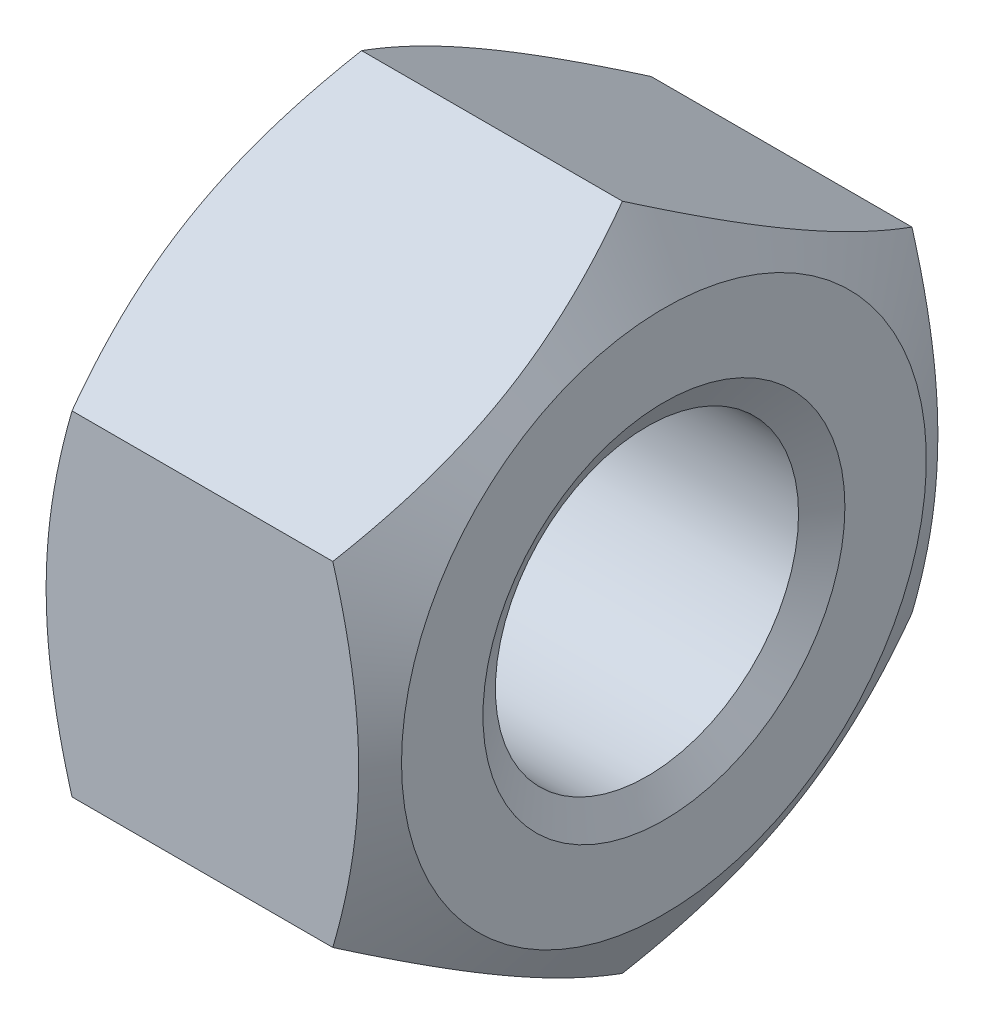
ISO-10303-21;
HEADER;
FILE_DESCRIPTION(('STEP AP214'),'2;1');
FILE_NAME('part.step','',(''),(''),'','','');
FILE_SCHEMA(('AUTOMOTIVE_DESIGN { 1 0 10303 214 1 1 1 1 }'));
ENDSEC;
DATA;
#1=APPLICATION_CONTEXT('core data for automotive mechanical design processes');
#2=APPLICATION_PROTOCOL_DEFINITION('international standard','automotive_design',2000,#1);
#3=PRODUCT_CONTEXT('',#1,'mechanical');
#4=PRODUCT('Part','Part','',(#3));
#5=PRODUCT_RELATED_PRODUCT_CATEGORY('part','',(#4));
#6=PRODUCT_DEFINITION_FORMATION('','',#4);
#7=PRODUCT_DEFINITION_CONTEXT('part definition',#1,'design');
#8=PRODUCT_DEFINITION('design','',#6,#7);
#9=PRODUCT_DEFINITION_SHAPE('','',#8);
#10=(LENGTH_UNIT() NAMED_UNIT(*) SI_UNIT(.MILLI.,.METRE.));
#11=(NAMED_UNIT(*) PLANE_ANGLE_UNIT() SI_UNIT($,.RADIAN.));
#12=(NAMED_UNIT(*) SI_UNIT($,.STERADIAN.) SOLID_ANGLE_UNIT());
#13=UNCERTAINTY_MEASURE_WITH_UNIT(LENGTH_MEASURE(1.E-05),#10,'distance_accuracy_value','');
#14=(GEOMETRIC_REPRESENTATION_CONTEXT(3) GLOBAL_UNCERTAINTY_ASSIGNED_CONTEXT((#13)) GLOBAL_UNIT_ASSIGNED_CONTEXT((#10,
#11,#12)) REPRESENTATION_CONTEXT('',''));
#15=CARTESIAN_POINT('',(0.,0.,0.));
#16=DIRECTION('',(0.,0.,1.));
#17=DIRECTION('',(1.,0.,0.));
#18=AXIS2_PLACEMENT_3D('',#15,#16,#17);
#19=CARTESIAN_POINT('',(0.,4.618802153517,8.));
#20=DIRECTION('',(0.,0.866025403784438,0.5));
#21=DIRECTION('',(0.,-0.5,0.866025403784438));
#22=AXIS2_PLACEMENT_3D('',#19,#20,#21);
#23=PLANE('',#22);
#24=CARTESIAN_POINT('',(8.35245610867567,4.61880213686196,8.00000002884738));
#25=CARTESIAN_POINT('',(8.41106048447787,4.72032750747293,7.82415292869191));
#26=CARTESIAN_POINT('',(8.46700497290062,4.82223139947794,7.64765021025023));
#27=CARTESIAN_POINT('',(8.57284159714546,5.02686676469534,7.29321136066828));
#28=CARTESIAN_POINT('',(8.62273112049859,5.1295985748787,7.11527464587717));
#29=CARTESIAN_POINT('',(8.7623378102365,5.4394387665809,6.57861569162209));
#30=CARTESIAN_POINT('',(8.84174318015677,5.64777019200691,6.21777507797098));
#31=CARTESIAN_POINT('',(8.93485338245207,5.95953412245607,5.67778411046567));
#32=CARTESIAN_POINT('',(8.96137739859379,6.06203531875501,5.50024683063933));
#33=CARTESIAN_POINT('',(9.0058527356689,6.26750119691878,5.14436949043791));
#34=CARTESIAN_POINT('',(9.02380481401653,6.37046583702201,4.96602950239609));
#35=CARTESIAN_POINT('',(9.05068130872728,6.57657235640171,4.60904253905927));
#36=CARTESIAN_POINT('',(9.05961596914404,6.67971390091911,4.430396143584));
#37=CARTESIAN_POINT('',(9.06826608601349,6.88609220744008,4.07293843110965));
#38=CARTESIAN_POINT('',(9.067981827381,6.9893289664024,3.89412711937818));
#39=CARTESIAN_POINT('',(9.05883609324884,7.18232642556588,3.55984571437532));
#40=CARTESIAN_POINT('',(9.05109027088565,7.27210075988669,3.404352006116));
#41=CARTESIAN_POINT('',(9.02877760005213,7.45143915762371,3.09372878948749));
#42=CARTESIAN_POINT('',(9.01421029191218,7.54100320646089,2.93859930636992));
#43=CARTESIAN_POINT('',(8.96062041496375,7.80934859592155,2.4738114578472));
#44=CARTESIAN_POINT('',(8.91171658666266,7.98765496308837,2.16497577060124));
#45=CARTESIAN_POINT('',(8.78945870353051,8.3461588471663,1.54402882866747));
#46=CARTESIAN_POINT('',(8.71558650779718,8.52631062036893,1.2319968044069));
#47=CARTESIAN_POINT('',(8.5479281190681,8.88392795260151,0.612585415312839));
#48=CARTESIAN_POINT('',(8.45418129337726,9.06139808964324,0.305198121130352));
#49=CARTESIAN_POINT('',(8.35245611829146,9.23760430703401,0.));
#50=B_SPLINE_CURVE_WITH_KNOTS('',3,(#24,#25,#26,#27,#28,#29,#30,#31,#32,#33,#34,#35,#36,#37,#38,
#39,#40,#41,#42,#43,#44,#45,#46,#47,#48,#49),.UNSPECIFIED.,.F.,.F.,(4,2,2,2,2,2,2,2,2,2,2,2,4),
(0.,0.633965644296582,1.26820385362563,2.53931507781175,3.15930424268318,3.77923861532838,
4.39846792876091,5.01767810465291,5.55669079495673,6.09573981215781,7.1746054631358,
8.27739518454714,9.37802059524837),.UNSPECIFIED.);
#51=CARTESIAN_POINT('',(8.35245611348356,4.61880214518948,8.00000001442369));
#52=VERTEX_POINT('',#51);
#53=CARTESIAN_POINT('',(8.35245611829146,9.23760430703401,0.));
#54=VERTEX_POINT('',#53);
#55=EDGE_CURVE('E175',#52,#54,#50,.T.);
#56=ORIENTED_EDGE('',*,*,#55,.T.);
#57=DIRECTION('',(1.,0.,0.));
#58=VECTOR('',#57,1.);
#59=CARTESIAN_POINT('',(0.,9.23760430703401,0.));
#60=LINE('',#59,#58);
#61=CARTESIAN_POINT('',(1.14754388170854,9.23760430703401,0.));
#62=VERTEX_POINT('',#61);
#63=EDGE_CURVE('E248',#62,#54,#60,.T.);
#64=ORIENTED_EDGE('',*,*,#63,.F.);
#65=CARTESIAN_POINT('',(1.14754388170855,9.23760430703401,0.));
#66=CARTESIAN_POINT('',(1.08893950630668,9.13607893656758,0.175847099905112));
#67=CARTESIAN_POINT('',(1.03299501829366,9.03417504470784,0.352349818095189));
#68=CARTESIAN_POINT('',(0.92715839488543,8.82953967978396,0.706788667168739));
#69=CARTESIAN_POINT('',(0.877268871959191,8.72680786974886,0.884725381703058));
#70=CARTESIAN_POINT('',(0.737662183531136,8.41696767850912,1.42138433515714));
#71=CARTESIAN_POINT('',(0.658256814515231,8.20863625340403,1.7822249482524));
#72=CARTESIAN_POINT('',(0.565146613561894,7.89687232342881,2.32221591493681));
#73=CARTESIAN_POINT('',(0.538622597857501,7.79437112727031,2.49975319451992));
#74=CARTESIAN_POINT('',(0.494147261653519,7.58890524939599,2.85563053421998));
#75=CARTESIAN_POINT('',(0.476195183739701,7.48594060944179,3.03397052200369));
#76=CARTESIAN_POINT('',(0.44931868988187,7.27983409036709,3.39095748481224));
#77=CARTESIAN_POINT('',(0.440384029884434,7.17669254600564,3.56960388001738));
#78=CARTESIAN_POINT('',(0.431733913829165,6.97031423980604,3.9270615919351));
#79=CARTESIAN_POINT('',(0.432018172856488,6.86707748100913,4.10587290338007));
#80=CARTESIAN_POINT('',(0.441163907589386,6.6740800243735,4.44015430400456));
#81=CARTESIAN_POINT('',(0.44890972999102,6.58430569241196,4.5956480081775));
#82=CARTESIAN_POINT('',(0.471222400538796,6.40496729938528,4.90627121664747));
#83=CARTESIAN_POINT('',(0.485789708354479,6.31540325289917,5.06140069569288));
#84=CARTESIAN_POINT('',(0.539379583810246,6.04705787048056,5.5261885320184));
#85=CARTESIAN_POINT('',(0.588283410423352,5.86875150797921,5.83502421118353));
#86=CARTESIAN_POINT('',(0.710541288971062,5.51024763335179,6.45597113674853));
#87=CARTESIAN_POINT('',(0.784413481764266,5.33009586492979,6.76800315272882));
#88=CARTESIAN_POINT('',(0.952071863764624,4.9724785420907,7.38741452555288));
#89=CARTESIAN_POINT('',(1.04581868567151,4.79500840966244,7.6948018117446));
#90=CARTESIAN_POINT('',(1.14754385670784,4.61880219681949,7.99999992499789));
#91=B_SPLINE_CURVE_WITH_KNOTS('',3,(#65,#66,#67,#68,#69,#70,#71,#72,#73,#74,#75,#76,#77,#78,#79,
#80,#81,#82,#83,#84,#85,#86,#87,#88,#89,#90),.UNSPECIFIED.,.F.,.F.,(4,2,2,2,2,2,2,2,2,2,2,2,4),
(0.,0.633965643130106,1.26820385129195,2.5393150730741,3.15930423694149,3.77923860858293,
4.39846792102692,5.01767809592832,5.55669077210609,6.09573977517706,7.17460539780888,
8.27739508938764,9.37802047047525),.UNSPECIFIED.);
#92=CARTESIAN_POINT('',(1.14754388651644,4.61880217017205,8.));
#93=VERTEX_POINT('',#92);
#94=EDGE_CURVE('E40',#62,#93,#91,.T.);
#95=ORIENTED_EDGE('',*,*,#94,.T.);
#96=DIRECTION('',(1.,0.,0.));
#97=VECTOR('',#96,1.);
#98=CARTESIAN_POINT('',(0.,4.61880215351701,8.));
#99=LINE('',#98,#97);
#100=EDGE_CURVE('E254',#52,#93,#99,.F.);
#101=ORIENTED_EDGE('',*,*,#100,.F.);
#102=EDGE_LOOP('',(#56,#64,#95,#101));
#103=FACE_BOUND('',#102,.T.);
#104=ADVANCED_FACE('F16',(#103),#23,.T.);
#105=CARTESIAN_POINT('',(0.,-4.61880215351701,8.));
#106=DIRECTION('',(0.,0.,1.));
#107=DIRECTION('',(1.,0.,0.));
#108=AXIS2_PLACEMENT_3D('',#105,#106,#107);
#109=PLANE('',#108);
#110=CARTESIAN_POINT('',(8.35245610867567,-4.6188021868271,8.));
#111=CARTESIAN_POINT('',(8.41106048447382,-4.41575144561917,8.));
#112=CARTESIAN_POINT('',(8.46700497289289,-4.21194366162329,8.));
#113=CARTESIAN_POINT('',(8.57284159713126,-3.80267293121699,8.));
#114=CARTESIAN_POINT('',(8.62273112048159,-3.59720931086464,8.));
#115=CARTESIAN_POINT('',(8.76233781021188,-2.97752892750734,8.));
#116=CARTESIAN_POINT('',(8.84174318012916,-2.56086607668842,8.));
#117=CARTESIAN_POINT('',(8.93485338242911,-1.93733821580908,8.));
#118=CARTESIAN_POINT('',(8.96137739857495,-1.73233582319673,8.));
#119=CARTESIAN_POINT('',(9.00585273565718,-1.32140406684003,8.));
#120=CARTESIAN_POINT('',(9.02380481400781,-1.11547478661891,8.));
#121=CARTESIAN_POINT('',(9.05068130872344,-0.703261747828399,8.));
#122=CARTESIAN_POINT('',(9.05961596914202,-0.496978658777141,8.));
#123=CARTESIAN_POINT('',(9.06826608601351,-0.0842220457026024,8.));
#124=CARTESIAN_POINT('',(9.06798182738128,0.122251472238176,8.));
#125=CARTESIAN_POINT('',(9.05883609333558,0.508246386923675,8.));
#126=CARTESIAN_POINT('',(9.05109027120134,0.687795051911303,8.));
#127=CARTESIAN_POINT('',(9.02877760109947,1.04647184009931,8.));
#128=CARTESIAN_POINT('',(9.0142102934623,1.22559993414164,8.));
#129=CARTESIAN_POINT('',(8.96062041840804,1.7622907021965,8.));
#130=CARTESIAN_POINT('',(8.91171659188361,2.11890342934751,8.));
#131=CARTESIAN_POINT('',(8.78945871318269,2.83591118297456,8.));
#132=CARTESIAN_POINT('',(8.71558652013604,3.19621472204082,8.));
#133=CARTESIAN_POINT('',(8.5479281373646,3.91144937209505,8.));
#134=CARTESIAN_POINT('',(8.45418131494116,4.26638963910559,8.));
#135=CARTESIAN_POINT('',(8.35245614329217,4.61880206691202,8.));
#136=B_SPLINE_CURVE_WITH_KNOTS('',3,(#110,#111,#112,#113,#114,#115,#116,#117,#118,#119,#120,
#121,#122,#123,#124,#125,#126,#127,#128,#129,#130,#131,#132,#133,#134,#135),.UNSPECIFIED.,.F.,
.F.,(4,2,2,2,2,2,2,2,2,2,2,2,4),(0.,0.633965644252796,1.26820385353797,2.53931507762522,
3.15930424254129,3.77923861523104,4.39846792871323,5.01767810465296,5.55669078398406,
6.09573979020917,7.17460541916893,8.27739511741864,9.37802050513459),.UNSPECIFIED.);
#137=CARTESIAN_POINT('',(8.35245611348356,-4.61880217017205,8.));
#138=VERTEX_POINT('',#137);
#139=EDGE_CURVE('E77',#138,#52,#136,.T.);
#140=ORIENTED_EDGE('',*,*,#139,.T.);
#141=ORIENTED_EDGE('',*,*,#100,.T.);
#142=CARTESIAN_POINT('',(1.14754389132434,4.61880218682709,8.));
#143=CARTESIAN_POINT('',(1.08893951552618,4.41575144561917,8.));
#144=CARTESIAN_POINT('',(1.03299502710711,4.21194366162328,8.));
#145=CARTESIAN_POINT('',(0.927158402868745,3.80267293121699,8.));
#146=CARTESIAN_POINT('',(0.877268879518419,3.59720931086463,8.));
#147=CARTESIAN_POINT('',(0.737662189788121,2.97752892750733,8.));
#148=CARTESIAN_POINT('',(0.658256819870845,2.56086607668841,8.));
#149=CARTESIAN_POINT('',(0.565146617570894,1.93733821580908,8.));
#150=CARTESIAN_POINT('',(0.538622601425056,1.73233582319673,8.));
#151=CARTESIAN_POINT('',(0.494147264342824,1.32140406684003,8.));
#152=CARTESIAN_POINT('',(0.476195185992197,1.11547478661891,8.));
#153=CARTESIAN_POINT('',(0.449318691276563,0.703261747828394,8.));
#154=CARTESIAN_POINT('',(0.440384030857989,0.496978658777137,8.));
#155=CARTESIAN_POINT('',(0.431733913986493,0.0842220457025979,8.));
#156=CARTESIAN_POINT('',(0.432018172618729,-0.12225147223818,8.));
#157=CARTESIAN_POINT('',(0.441163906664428,-0.508246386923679,8.));
#158=CARTESIAN_POINT('',(0.448909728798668,-0.687795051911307,8.));
#159=CARTESIAN_POINT('',(0.47122239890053,-1.04647184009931,8.));
#160=CARTESIAN_POINT('',(0.485789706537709,-1.22559993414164,8.));
#161=CARTESIAN_POINT('',(0.539379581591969,-1.7622907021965,8.));
#162=CARTESIAN_POINT('',(0.588283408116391,-2.11890342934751,8.));
#163=CARTESIAN_POINT('',(0.71054128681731,-2.83591118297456,8.));
#164=CARTESIAN_POINT('',(0.784413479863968,-3.19621472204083,8.));
#165=CARTESIAN_POINT('',(0.9520718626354,-3.91144937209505,8.));
#166=CARTESIAN_POINT('',(1.04581868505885,-4.2663896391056,8.));
#167=CARTESIAN_POINT('',(1.14754385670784,-4.61880206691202,8.));
#168=B_SPLINE_CURVE_WITH_KNOTS('',3,(#142,#143,#144,#145,#146,#147,#148,#149,#150,#151,#152,
#153,#154,#155,#156,#157,#158,#159,#160,#161,#162,#163,#164,#165,#166,#167),.UNSPECIFIED.,.F.,
.F.,(4,2,2,2,2,2,2,2,2,2,2,2,4),(0.,0.633965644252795,1.26820385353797,2.53931507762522,
3.15930424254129,3.77923861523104,4.39846792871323,5.01767810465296,5.55669078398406,
6.09573979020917,7.17460541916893,8.27739511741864,9.37802050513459),.UNSPECIFIED.);
#169=CARTESIAN_POINT('',(1.14754388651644,-4.61880214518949,8.00000001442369));
#170=VERTEX_POINT('',#169);
#171=EDGE_CURVE('E98',#93,#170,#168,.T.);
#172=ORIENTED_EDGE('',*,*,#171,.T.);
#173=DIRECTION('',(1.,0.,0.));
#174=VECTOR('',#173,1.);
#175=CARTESIAN_POINT('',(0.,-4.61880215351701,8.));
#176=LINE('',#175,#174);
#177=EDGE_CURVE('E92',#138,#170,#176,.F.);
#178=ORIENTED_EDGE('',*,*,#177,.F.);
#179=EDGE_LOOP('',(#140,#141,#172,#178));
#180=FACE_BOUND('',#179,.T.);
#181=ADVANCED_FACE('F185',(#180),#109,.T.);
#182=CARTESIAN_POINT('',(0.,-9.23760430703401,0.));
#183=DIRECTION('',(0.,-0.866025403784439,0.5));
#184=DIRECTION('',(0.,-0.5,-0.866025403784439));
#185=AXIS2_PLACEMENT_3D('',#182,#183,#184);
#186=PLANE('',#185);
#187=CARTESIAN_POINT('',(8.35245611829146,-9.23760430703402,0.));
#188=CARTESIAN_POINT('',(8.41106049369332,-9.13607893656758,0.175847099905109));
#189=CARTESIAN_POINT('',(8.46700498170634,-9.03417504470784,0.352349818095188));
#190=CARTESIAN_POINT('',(8.57284160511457,-8.82953967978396,0.706788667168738));
#191=CARTESIAN_POINT('',(8.62273112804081,-8.72680786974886,0.884725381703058));
#192=CARTESIAN_POINT('',(8.76233781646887,-8.41696767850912,1.42138433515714));
#193=CARTESIAN_POINT('',(8.84174318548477,-8.20863625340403,1.78222494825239));
#194=CARTESIAN_POINT('',(8.93485338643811,-7.89687232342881,2.32221591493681));
#195=CARTESIAN_POINT('',(8.9613774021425,-7.79437112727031,2.49975319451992));
#196=CARTESIAN_POINT('',(9.00585273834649,-7.58890524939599,2.85563053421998));
#197=CARTESIAN_POINT('',(9.0238048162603,-7.48594060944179,3.03397052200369));
#198=CARTESIAN_POINT('',(9.05068131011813,-7.27983409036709,3.39095748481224));
#199=CARTESIAN_POINT('',(9.05961597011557,-7.17669254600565,3.56960388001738));
#200=CARTESIAN_POINT('',(9.06826608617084,-6.97031423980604,3.9270615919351));
#201=CARTESIAN_POINT('',(9.06798182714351,-6.86707748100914,4.10587290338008));
#202=CARTESIAN_POINT('',(9.05883609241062,-6.67408002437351,4.44015430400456));
#203=CARTESIAN_POINT('',(9.05109027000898,-6.58430569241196,4.5956480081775));
#204=CARTESIAN_POINT('',(9.02877759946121,-6.40496729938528,4.90627121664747));
#205=CARTESIAN_POINT('',(9.01421029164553,-6.31540325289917,5.06140069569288));
#206=CARTESIAN_POINT('',(8.96062041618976,-6.04705787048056,5.5261885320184));
#207=CARTESIAN_POINT('',(8.91171658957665,-5.86875150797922,5.83502421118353));
#208=CARTESIAN_POINT('',(8.78945871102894,-5.51024763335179,6.45597113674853));
#209=CARTESIAN_POINT('',(8.71558651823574,-5.33009586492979,6.76800315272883));
#210=CARTESIAN_POINT('',(8.54792813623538,-4.97247854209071,7.38741452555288));
#211=CARTESIAN_POINT('',(8.45418131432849,-4.79500840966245,7.6948018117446));
#212=CARTESIAN_POINT('',(8.35245614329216,-4.61880219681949,7.9999999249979));
#213=B_SPLINE_CURVE_WITH_KNOTS('',3,(#187,#188,#189,#190,#191,#192,#193,#194,#195,#196,#197,
#198,#199,#200,#201,#202,#203,#204,#205,#206,#207,#208,#209,#210,#211,#212),.UNSPECIFIED.,.F.,
.F.,(4,2,2,2,2,2,2,2,2,2,2,2,4),(0.,0.633965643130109,1.26820385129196,2.5393150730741,
3.15930423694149,3.77923860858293,4.39846792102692,5.01767809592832,5.55669077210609,
6.09573977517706,7.17460539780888,8.27739508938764,9.37802047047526),.UNSPECIFIED.);
#214=CARTESIAN_POINT('',(8.35245611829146,-9.23760430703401,0.));
#215=VERTEX_POINT('',#214);
#216=EDGE_CURVE('E20',#215,#138,#213,.T.);
#217=ORIENTED_EDGE('',*,*,#216,.T.);
#218=ORIENTED_EDGE('',*,*,#177,.T.);
#219=CARTESIAN_POINT('',(1.14754389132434,-4.61880213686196,8.00000002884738));
#220=CARTESIAN_POINT('',(1.08893951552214,-4.72032750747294,7.82415292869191));
#221=CARTESIAN_POINT('',(1.03299502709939,-4.82223139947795,7.64765021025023));
#222=CARTESIAN_POINT('',(0.927158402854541,-5.02686676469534,7.29321136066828));
#223=CARTESIAN_POINT('',(0.877268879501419,-5.12959857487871,7.11527464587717));
#224=CARTESIAN_POINT('',(0.737662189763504,-5.4394387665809,6.57861569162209));
#225=CARTESIAN_POINT('',(0.658256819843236,-5.64777019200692,6.21777507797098));
#226=CARTESIAN_POINT('',(0.565146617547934,-5.95953412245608,5.67778411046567));
#227=CARTESIAN_POINT('',(0.538622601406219,-6.06203531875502,5.50024683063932));
#228=CARTESIAN_POINT('',(0.494147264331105,-6.26750119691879,5.14436949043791));
#229=CARTESIAN_POINT('',(0.476195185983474,-6.37046583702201,4.96602950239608));
#230=CARTESIAN_POINT('',(0.449318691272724,-6.57657235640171,4.60904253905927));
#231=CARTESIAN_POINT('',(0.440384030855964,-6.67971390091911,4.43039614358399));
#232=CARTESIAN_POINT('',(0.43173391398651,-6.88609220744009,4.07293843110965));
#233=CARTESIAN_POINT('',(0.432018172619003,-6.9893289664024,3.89412711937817));
#234=CARTESIAN_POINT('',(0.441163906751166,-7.18232642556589,3.55984571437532));
#235=CARTESIAN_POINT('',(0.448909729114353,-7.2721007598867,3.404352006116));
#236=CARTESIAN_POINT('',(0.471222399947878,-7.45143915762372,3.09372878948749));
#237=CARTESIAN_POINT('',(0.485789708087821,-7.5410032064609,2.93859930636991));
#238=CARTESIAN_POINT('',(0.539379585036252,-7.80934859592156,2.47381145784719));
#239=CARTESIAN_POINT('',(0.588283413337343,-7.98765496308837,2.16497577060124));
#240=CARTESIAN_POINT('',(0.710541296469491,-8.34615884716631,1.54402882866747));
#241=CARTESIAN_POINT('',(0.784413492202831,-8.52631062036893,1.2319968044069));
#242=CARTESIAN_POINT('',(0.952071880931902,-8.88392795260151,0.612585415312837));
#243=CARTESIAN_POINT('',(1.04581870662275,-9.06139808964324,0.305198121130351));
#244=CARTESIAN_POINT('',(1.14754388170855,-9.23760430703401,0.));
#245=B_SPLINE_CURVE_WITH_KNOTS('',3,(#219,#220,#221,#222,#223,#224,#225,#226,#227,#228,#229,
#230,#231,#232,#233,#234,#235,#236,#237,#238,#239,#240,#241,#242,#243,#244),.UNSPECIFIED.,.F.,
.F.,(4,2,2,2,2,2,2,2,2,2,2,2,4),(0.,0.633965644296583,1.26820385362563,2.53931507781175,
3.15930424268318,3.77923861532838,4.39846792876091,5.01767810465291,5.55669079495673,
6.09573981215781,7.1746054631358,8.27739518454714,9.37802059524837),.UNSPECIFIED.);
#246=CARTESIAN_POINT('',(1.14754388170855,-9.23760430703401,0.));
#247=VERTEX_POINT('',#246);
#248=EDGE_CURVE('E87',#170,#247,#245,.T.);
#249=ORIENTED_EDGE('',*,*,#248,.T.);
#250=DIRECTION('',(1.,0.,0.));
#251=VECTOR('',#250,1.);
#252=CARTESIAN_POINT('',(0.,-9.23760430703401,0.));
#253=LINE('',#252,#251);
#254=EDGE_CURVE('E83',#215,#247,#253,.F.);
#255=ORIENTED_EDGE('',*,*,#254,.F.);
#256=EDGE_LOOP('',(#217,#218,#249,#255));
#257=FACE_BOUND('',#256,.T.);
#258=ADVANCED_FACE('F84',(#257),#186,.T.);
#259=CARTESIAN_POINT('',(0.,-4.61880215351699,-8.00000000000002));
#260=DIRECTION('',(0.,-0.866025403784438,-0.500000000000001));
#261=DIRECTION('',(0.,0.500000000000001,-0.866025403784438));
#262=AXIS2_PLACEMENT_3D('',#259,#260,#261);
#263=PLANE('',#262);
#264=CARTESIAN_POINT('',(8.35245610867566,-4.61880213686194,-8.0000000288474));
#265=CARTESIAN_POINT('',(8.41106048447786,-4.72032750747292,-7.82415292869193));
#266=CARTESIAN_POINT('',(8.46700497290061,-4.82223139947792,-7.64765021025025));
#267=CARTESIAN_POINT('',(8.57284159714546,-5.02686676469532,-7.2932113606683));
#268=CARTESIAN_POINT('',(8.62273112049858,-5.12959857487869,-7.11527464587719));
#269=CARTESIAN_POINT('',(8.7623378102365,-5.43943876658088,-6.57861569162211));
#270=CARTESIAN_POINT('',(8.84174318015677,-5.6477701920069,-6.217775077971));
#271=CARTESIAN_POINT('',(8.93485338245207,-5.95953412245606,-5.67778411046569));
#272=CARTESIAN_POINT('',(8.96137739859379,-6.06203531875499,-5.50024683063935));
#273=CARTESIAN_POINT('',(9.0058527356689,-6.26750119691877,-5.14436949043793));
#274=CARTESIAN_POINT('',(9.02380481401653,-6.37046583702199,-4.9660295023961));
#275=CARTESIAN_POINT('',(9.05068130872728,-6.57657235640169,-4.60904253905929));
#276=CARTESIAN_POINT('',(9.05961596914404,-6.6797139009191,-4.43039614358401));
#277=CARTESIAN_POINT('',(9.0682660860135,-6.88609220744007,-4.07293843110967));
#278=CARTESIAN_POINT('',(9.067981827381,-6.98932896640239,-3.89412711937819));
#279=CARTESIAN_POINT('',(9.05883609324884,-7.18232642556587,-3.55984571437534));
#280=CARTESIAN_POINT('',(9.05109027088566,-7.27210075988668,-3.40435200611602));
#281=CARTESIAN_POINT('',(9.02877760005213,-7.4514391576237,-3.0937287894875));
#282=CARTESIAN_POINT('',(9.01421029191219,-7.54100320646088,-2.93859930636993));
#283=CARTESIAN_POINT('',(8.96062041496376,-7.80934859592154,-2.47381145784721));
#284=CARTESIAN_POINT('',(8.91171658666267,-7.98765496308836,-2.16497577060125));
#285=CARTESIAN_POINT('',(8.78945870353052,-8.3461588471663,-1.54402882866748));
#286=CARTESIAN_POINT('',(8.71558650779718,-8.52631062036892,-1.23199680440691));
#287=CARTESIAN_POINT('',(8.54792811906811,-8.8839279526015,-0.61258541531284));
#288=CARTESIAN_POINT('',(8.45418129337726,-9.06139808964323,-0.305198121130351));
#289=CARTESIAN_POINT('',(8.35245611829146,-9.23760430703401,0.));
#290=B_SPLINE_CURVE_WITH_KNOTS('',3,(#264,#265,#266,#267,#268,#269,#270,#271,#272,#273,#274,
#275,#276,#277,#278,#279,#280,#281,#282,#283,#284,#285,#286,#287,#288,#289),.UNSPECIFIED.,.F.,
.F.,(4,2,2,2,2,2,2,2,2,2,2,2,4),(0.,0.633965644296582,1.26820385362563,2.53931507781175,
3.15930424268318,3.77923861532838,4.39846792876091,5.01767810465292,5.55669079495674,
6.09573981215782,7.17460546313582,8.27739518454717,9.3780205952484),.UNSPECIFIED.);
#291=CARTESIAN_POINT('',(8.35245611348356,-4.61880214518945,-8.00000001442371));
#292=VERTEX_POINT('',#291);
#293=EDGE_CURVE('E73',#292,#215,#290,.T.);
#294=ORIENTED_EDGE('',*,*,#293,.T.);
#295=ORIENTED_EDGE('',*,*,#254,.T.);
#296=CARTESIAN_POINT('',(1.14754388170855,-9.23760430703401,0.));
#297=CARTESIAN_POINT('',(1.08893950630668,-9.13607893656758,-0.175847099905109));
#298=CARTESIAN_POINT('',(1.03299501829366,-9.03417504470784,-0.352349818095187));
#299=CARTESIAN_POINT('',(0.927158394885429,-8.82953967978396,-0.706788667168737));
#300=CARTESIAN_POINT('',(0.877268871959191,-8.72680786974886,-0.884725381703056));
#301=CARTESIAN_POINT('',(0.737662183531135,-8.41696767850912,-1.42138433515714));
#302=CARTESIAN_POINT('',(0.658256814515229,-8.20863625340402,-1.78222494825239));
#303=CARTESIAN_POINT('',(0.565146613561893,-7.89687232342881,-2.32221591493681));
#304=CARTESIAN_POINT('',(0.5386225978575,-7.79437112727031,-2.49975319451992));
#305=CARTESIAN_POINT('',(0.494147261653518,-7.58890524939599,-2.85563053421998));
#306=CARTESIAN_POINT('',(0.476195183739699,-7.48594060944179,-3.03397052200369));
#307=CARTESIAN_POINT('',(0.449318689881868,-7.27983409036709,-3.39095748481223));
#308=CARTESIAN_POINT('',(0.440384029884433,-7.17669254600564,-3.56960388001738));
#309=CARTESIAN_POINT('',(0.431733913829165,-6.97031423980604,-3.9270615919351));
#310=CARTESIAN_POINT('',(0.432018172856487,-6.86707748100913,-4.10587290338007));
#311=CARTESIAN_POINT('',(0.441163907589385,-6.6740800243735,-4.44015430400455));
#312=CARTESIAN_POINT('',(0.448909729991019,-6.58430569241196,-4.5956480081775));
#313=CARTESIAN_POINT('',(0.471222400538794,-6.40496729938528,-4.90627121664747));
#314=CARTESIAN_POINT('',(0.485789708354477,-6.31540325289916,-5.06140069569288));
#315=CARTESIAN_POINT('',(0.539379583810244,-6.04705787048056,-5.52618853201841));
#316=CARTESIAN_POINT('',(0.588283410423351,-5.86875150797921,-5.83502421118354));
#317=CARTESIAN_POINT('',(0.710541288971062,-5.51024763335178,-6.45597113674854));
#318=CARTESIAN_POINT('',(0.784413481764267,-5.33009586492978,-6.76800315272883));
#319=CARTESIAN_POINT('',(0.952071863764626,-4.97247854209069,-7.38741452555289));
#320=CARTESIAN_POINT('',(1.04581868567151,-4.79500840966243,-7.69480181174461));
#321=CARTESIAN_POINT('',(1.14754385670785,-4.61880219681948,-7.99999992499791));
#322=B_SPLINE_CURVE_WITH_KNOTS('',3,(#296,#297,#298,#299,#300,#301,#302,#303,#304,#305,#306,
#307,#308,#309,#310,#311,#312,#313,#314,#315,#316,#317,#318,#319,#320,#321),.UNSPECIFIED.,.F.,
.F.,(4,2,2,2,2,2,2,2,2,2,2,2,4),(0.,0.633965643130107,1.26820385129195,2.5393150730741,
3.15930423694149,3.77923860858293,4.39846792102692,5.01767809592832,5.55669077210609,
6.09573977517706,7.17460539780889,8.27739508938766,9.37802047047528),.UNSPECIFIED.);
#323=CARTESIAN_POINT('',(1.14754388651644,-4.61880217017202,-8.00000000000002));
#324=VERTEX_POINT('',#323);
#325=EDGE_CURVE('E128',#247,#324,#322,.T.);
#326=ORIENTED_EDGE('',*,*,#325,.T.);
#327=DIRECTION('',(1.,0.,0.));
#328=VECTOR('',#327,1.);
#329=CARTESIAN_POINT('',(0.,-4.61880215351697,-8.00000000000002));
#330=LINE('',#329,#328);
#331=EDGE_CURVE('E91',#292,#324,#330,.F.);
#332=ORIENTED_EDGE('',*,*,#331,.F.);
#333=EDGE_LOOP('',(#294,#295,#326,#332));
#334=FACE_BOUND('',#333,.T.);
#335=ADVANCED_FACE('F94',(#334),#263,.T.);
#336=CARTESIAN_POINT('',(0.,4.61880215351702,-8.));
#337=DIRECTION('',(0.,0.,-1.));
#338=DIRECTION('',(0.,1.,0.));
#339=AXIS2_PLACEMENT_3D('',#336,#337,#338);
#340=PLANE('',#339);
#341=CARTESIAN_POINT('',(8.35245610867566,4.6188021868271,-8.));
#342=CARTESIAN_POINT('',(8.41106048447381,4.41575144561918,-8.));
#343=CARTESIAN_POINT('',(8.46700497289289,4.21194366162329,-8.));
#344=CARTESIAN_POINT('',(8.57284159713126,3.802672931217,-8.));
#345=CARTESIAN_POINT('',(8.62273112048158,3.59720931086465,-8.));
#346=CARTESIAN_POINT('',(8.76233781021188,2.97752892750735,-8.));
#347=CARTESIAN_POINT('',(8.84174318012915,2.56086607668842,-8.));
#348=CARTESIAN_POINT('',(8.9348533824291,1.93733821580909,-8.00000000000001));
#349=CARTESIAN_POINT('',(8.96137739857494,1.73233582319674,-8.00000000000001));
#350=CARTESIAN_POINT('',(9.00585273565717,1.32140406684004,-8.00000000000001));
#351=CARTESIAN_POINT('',(9.0238048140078,1.11547478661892,-8.00000000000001));
#352=CARTESIAN_POINT('',(9.05068130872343,0.703261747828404,-8.00000000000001));
#353=CARTESIAN_POINT('',(9.05961596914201,0.496978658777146,-8.00000000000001));
#354=CARTESIAN_POINT('',(9.0682660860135,0.0842220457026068,-8.00000000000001));
#355=CARTESIAN_POINT('',(9.06798182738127,-0.122251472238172,-8.00000000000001));
#356=CARTESIAN_POINT('',(9.05883609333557,-0.50824638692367,-8.00000000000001));
#357=CARTESIAN_POINT('',(9.05109027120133,-0.687795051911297,-8.00000000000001));
#358=CARTESIAN_POINT('',(9.02877760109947,-1.0464718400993,-8.00000000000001));
#359=CARTESIAN_POINT('',(9.01421029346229,-1.22559993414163,-8.00000000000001));
#360=CARTESIAN_POINT('',(8.96062041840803,-1.76229070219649,-8.00000000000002));
#361=CARTESIAN_POINT('',(8.91171659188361,-2.11890342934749,-8.00000000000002));
#362=CARTESIAN_POINT('',(8.78945871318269,-2.83591118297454,-8.00000000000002));
#363=CARTESIAN_POINT('',(8.71558652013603,-3.1962147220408,-8.00000000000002));
#364=CARTESIAN_POINT('',(8.5479281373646,-3.91144937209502,-8.00000000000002));
#365=CARTESIAN_POINT('',(8.45418131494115,-4.26638963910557,-8.00000000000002));
#366=CARTESIAN_POINT('',(8.35245614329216,-4.61880206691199,-8.00000000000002));
#367=B_SPLINE_CURVE_WITH_KNOTS('',3,(#341,#342,#343,#344,#345,#346,#347,#348,#349,#350,#351,
#352,#353,#354,#355,#356,#357,#358,#359,#360,#361,#362,#363,#364,#365,#366),.UNSPECIFIED.,.F.,
.F.,(4,2,2,2,2,2,2,2,2,2,2,2,4),(0.,0.633965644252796,1.26820385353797,2.53931507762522,
3.15930424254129,3.77923861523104,4.39846792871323,5.01767810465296,5.55669078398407,
6.09573979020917,7.17460541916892,8.27739511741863,9.37802050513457),.UNSPECIFIED.);
#368=CARTESIAN_POINT('',(8.35245611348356,4.61880217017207,-8.));
#369=VERTEX_POINT('',#368);
#370=EDGE_CURVE('E96',#369,#292,#367,.T.);
#371=ORIENTED_EDGE('',*,*,#370,.T.);
#372=ORIENTED_EDGE('',*,*,#331,.T.);
#373=CARTESIAN_POINT('',(1.14754389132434,-4.61880218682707,-8.00000000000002));
#374=CARTESIAN_POINT('',(1.08893951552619,-4.41575144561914,-8.00000000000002));
#375=CARTESIAN_POINT('',(1.03299502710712,-4.21194366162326,-8.00000000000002));
#376=CARTESIAN_POINT('',(0.927158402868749,-3.80267293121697,-8.00000000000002));
#377=CARTESIAN_POINT('',(0.877268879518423,-3.59720931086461,-8.00000000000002));
#378=CARTESIAN_POINT('',(0.737662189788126,-2.97752892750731,-8.00000000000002));
#379=CARTESIAN_POINT('',(0.65825681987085,-2.56086607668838,-8.00000000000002));
#380=CARTESIAN_POINT('',(0.565146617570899,-1.93733821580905,-8.00000000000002));
#381=CARTESIAN_POINT('',(0.538622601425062,-1.7323358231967,-8.00000000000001));
#382=CARTESIAN_POINT('',(0.494147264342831,-1.32140406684,-8.00000000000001));
#383=CARTESIAN_POINT('',(0.476195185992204,-1.11547478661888,-8.00000000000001));
#384=CARTESIAN_POINT('',(0.449318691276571,-0.703261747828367,-8.00000000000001));
#385=CARTESIAN_POINT('',(0.440384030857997,-0.49697865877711,-8.00000000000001));
#386=CARTESIAN_POINT('',(0.431733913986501,-0.0842220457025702,-8.00000000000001));
#387=CARTESIAN_POINT('',(0.432018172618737,0.122251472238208,-8.00000000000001));
#388=CARTESIAN_POINT('',(0.441163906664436,0.508246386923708,-8.00000000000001));
#389=CARTESIAN_POINT('',(0.448909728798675,0.687795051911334,-8.00000000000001));
#390=CARTESIAN_POINT('',(0.471222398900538,1.04647184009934,-8.00000000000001));
#391=CARTESIAN_POINT('',(0.485789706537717,1.22559993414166,-8.00000000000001));
#392=CARTESIAN_POINT('',(0.539379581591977,1.76229070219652,-8.00000000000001));
#393=CARTESIAN_POINT('',(0.588283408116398,2.11890342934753,-8.00000000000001));
#394=CARTESIAN_POINT('',(0.710541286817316,2.83591118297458,-8.00000000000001));
#395=CARTESIAN_POINT('',(0.784413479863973,3.19621472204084,-8.));
#396=CARTESIAN_POINT('',(0.952071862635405,3.91144937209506,-8.));
#397=CARTESIAN_POINT('',(1.04581868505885,4.26638963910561,-8.));
#398=CARTESIAN_POINT('',(1.14754385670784,4.61880206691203,-8.));
#399=B_SPLINE_CURVE_WITH_KNOTS('',3,(#373,#374,#375,#376,#377,#378,#379,#380,#381,#382,#383,
#384,#385,#386,#387,#388,#389,#390,#391,#392,#393,#394,#395,#396,#397,#398),.UNSPECIFIED.,.F.,
.F.,(4,2,2,2,2,2,2,2,2,2,2,2,4),(0.,0.633965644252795,1.26820385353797,2.53931507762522,
3.15930424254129,3.77923861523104,4.39846792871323,5.01767810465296,5.55669078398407,
6.09573979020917,7.17460541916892,8.27739511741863,9.37802050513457),.UNSPECIFIED.);
#400=CARTESIAN_POINT('',(1.14754388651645,4.6188021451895,-8.00000001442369));
#401=VERTEX_POINT('',#400);
#402=EDGE_CURVE('E134',#324,#401,#399,.T.);
#403=ORIENTED_EDGE('',*,*,#402,.T.);
#404=DIRECTION('',(1.,0.,0.));
#405=VECTOR('',#404,1.);
#406=CARTESIAN_POINT('',(0.,4.61880215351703,-7.99999999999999));
#407=LINE('',#406,#405);
#408=EDGE_CURVE('E80',#369,#401,#407,.F.);
#409=ORIENTED_EDGE('',*,*,#408,.F.);
#410=EDGE_LOOP('',(#371,#372,#403,#409));
#411=FACE_BOUND('',#410,.T.);
#412=ADVANCED_FACE('F121',(#411),#340,.T.);
#413=CARTESIAN_POINT('',(0.,9.23760430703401,0.));
#414=DIRECTION('',(0.,0.86602540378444,-0.499999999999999));
#415=DIRECTION('',(0.,0.499999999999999,0.86602540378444));
#416=AXIS2_PLACEMENT_3D('',#413,#414,#415);
#417=PLANE('',#416);
#418=CARTESIAN_POINT('',(8.35245611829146,9.23760430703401,0.));
#419=CARTESIAN_POINT('',(8.41106049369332,9.13607893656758,-0.175847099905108));
#420=CARTESIAN_POINT('',(8.46700498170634,9.03417504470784,-0.352349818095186));
#421=CARTESIAN_POINT('',(8.57284160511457,8.82953967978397,-0.706788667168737));
#422=CARTESIAN_POINT('',(8.62273112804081,8.72680786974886,-0.884725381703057));
#423=CARTESIAN_POINT('',(8.76233781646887,8.41696767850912,-1.42138433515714));
#424=CARTESIAN_POINT('',(8.84174318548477,8.20863625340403,-1.7822249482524));
#425=CARTESIAN_POINT('',(8.93485338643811,7.89687232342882,-2.32221591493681));
#426=CARTESIAN_POINT('',(8.9613774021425,7.79437112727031,-2.49975319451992));
#427=CARTESIAN_POINT('',(9.00585273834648,7.58890524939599,-2.85563053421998));
#428=CARTESIAN_POINT('',(9.0238048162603,7.48594060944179,-3.0339705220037));
#429=CARTESIAN_POINT('',(9.05068131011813,7.27983409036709,-3.39095748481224));
#430=CARTESIAN_POINT('',(9.05961597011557,7.17669254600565,-3.56960388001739));
#431=CARTESIAN_POINT('',(9.06826608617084,6.97031423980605,-3.92706159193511));
#432=CARTESIAN_POINT('',(9.06798182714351,6.86707748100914,-4.10587290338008));
#433=CARTESIAN_POINT('',(9.05883609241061,6.67408002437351,-4.44015430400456));
#434=CARTESIAN_POINT('',(9.05109027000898,6.58430569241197,-4.59564800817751));
#435=CARTESIAN_POINT('',(9.0287775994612,6.40496729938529,-4.90627121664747));
#436=CARTESIAN_POINT('',(9.01421029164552,6.31540325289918,-5.06140069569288));
#437=CARTESIAN_POINT('',(8.96062041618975,6.04705787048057,-5.52618853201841));
#438=CARTESIAN_POINT('',(8.91171658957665,5.86875150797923,-5.83502421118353));
#439=CARTESIAN_POINT('',(8.78945871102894,5.51024763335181,-6.45597113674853));
#440=CARTESIAN_POINT('',(8.71558651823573,5.3300958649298,-6.76800315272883));
#441=CARTESIAN_POINT('',(8.54792813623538,4.97247854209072,-7.38741452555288));
#442=CARTESIAN_POINT('',(8.45418131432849,4.79500840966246,-7.6948018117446));
#443=CARTESIAN_POINT('',(8.35245614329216,4.61880219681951,-7.99999992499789));
#444=B_SPLINE_CURVE_WITH_KNOTS('',3,(#418,#419,#420,#421,#422,#423,#424,#425,#426,#427,#428,
#429,#430,#431,#432,#433,#434,#435,#436,#437,#438,#439,#440,#441,#442,#443),.UNSPECIFIED.,.F.,
.F.,(4,2,2,2,2,2,2,2,2,2,2,2,4),(0.,0.633965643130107,1.26820385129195,2.5393150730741,
3.15930423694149,3.77923860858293,4.39846792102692,5.01767809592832,5.55669077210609,
6.09573977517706,7.17460539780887,8.27739508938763,9.37802047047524),.UNSPECIFIED.);
#445=EDGE_CURVE('E100',#54,#369,#444,.T.);
#446=ORIENTED_EDGE('',*,*,#445,.T.);
#447=ORIENTED_EDGE('',*,*,#408,.T.);
#448=CARTESIAN_POINT('',(1.14754389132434,4.61880213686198,-8.00000002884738));
#449=CARTESIAN_POINT('',(1.08893951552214,4.72032750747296,-7.82415292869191));
#450=CARTESIAN_POINT('',(1.03299502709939,4.82223139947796,-7.64765021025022));
#451=CARTESIAN_POINT('',(0.927158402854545,5.02686676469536,-7.29321136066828));
#452=CARTESIAN_POINT('',(0.877268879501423,5.12959857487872,-7.11527464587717));
#453=CARTESIAN_POINT('',(0.737662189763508,5.43943876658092,-6.57861569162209));
#454=CARTESIAN_POINT('',(0.658256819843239,5.64777019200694,-6.21777507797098));
#455=CARTESIAN_POINT('',(0.565146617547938,5.95953412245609,-5.67778411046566));
#456=CARTESIAN_POINT('',(0.538622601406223,6.06203531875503,-5.50024683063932));
#457=CARTESIAN_POINT('',(0.494147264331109,6.2675011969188,-5.1443694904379));
#458=CARTESIAN_POINT('',(0.476195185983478,6.37046583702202,-4.96602950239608));
#459=CARTESIAN_POINT('',(0.449318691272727,6.57657235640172,-4.60904253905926));
#460=CARTESIAN_POINT('',(0.440384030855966,6.67971390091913,-4.43039614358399));
#461=CARTESIAN_POINT('',(0.431733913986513,6.8860922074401,-4.07293843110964));
#462=CARTESIAN_POINT('',(0.432018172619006,6.98932896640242,-3.89412711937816));
#463=CARTESIAN_POINT('',(0.441163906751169,7.1823264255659,-3.55984571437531));
#464=CARTESIAN_POINT('',(0.448909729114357,7.27210075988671,-3.40435200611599));
#465=CARTESIAN_POINT('',(0.471222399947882,7.45143915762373,-3.09372878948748));
#466=CARTESIAN_POINT('',(0.485789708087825,7.5410032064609,-2.93859930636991));
#467=CARTESIAN_POINT('',(0.539379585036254,7.80934859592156,-2.47381145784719));
#468=CARTESIAN_POINT('',(0.588283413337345,7.98765496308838,-2.16497577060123));
#469=CARTESIAN_POINT('',(0.710541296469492,8.34615884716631,-1.54402882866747));
#470=CARTESIAN_POINT('',(0.784413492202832,8.52631062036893,-1.2319968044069));
#471=CARTESIAN_POINT('',(0.952071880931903,8.88392795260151,-0.612585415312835));
#472=CARTESIAN_POINT('',(1.04581870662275,9.06139808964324,-0.305198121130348));
#473=CARTESIAN_POINT('',(1.14754388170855,9.23760430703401,0.));
#474=B_SPLINE_CURVE_WITH_KNOTS('',3,(#448,#449,#450,#451,#452,#453,#454,#455,#456,#457,#458,
#459,#460,#461,#462,#463,#464,#465,#466,#467,#468,#469,#470,#471,#472,#473),.UNSPECIFIED.,.F.,
.F.,(4,2,2,2,2,2,2,2,2,2,2,2,4),(0.,0.633965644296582,1.26820385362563,2.53931507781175,
3.15930424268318,3.77923861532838,4.39846792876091,5.01767810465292,5.55669079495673,
6.09573981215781,7.1746054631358,8.27739518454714,9.37802059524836),.UNSPECIFIED.);
#475=EDGE_CURVE('E156',#401,#62,#474,.T.);
#476=ORIENTED_EDGE('',*,*,#475,.T.);
#477=ORIENTED_EDGE('',*,*,#63,.T.);
#478=EDGE_LOOP('',(#446,#447,#476,#477));
#479=FACE_BOUND('',#478,.T.);
#480=ADVANCED_FACE('F164',(#479),#417,.T.);
#481=CARTESIAN_POINT('',(9.5,0.,0.));
#482=DIRECTION('',(-1.,0.,0.));
#483=DIRECTION('',(0.,0.,1.));
#484=AXIS2_PLACEMENT_3D('',#481,#482,#483);
#485=CONICAL_SURFACE('',#484,7.25000000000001,1.0471975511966);
#486=CARTESIAN_POINT('',(9.5,0.,0.));
#487=DIRECTION('',(-1.,0.,0.));
#488=DIRECTION('',(0.,0.,1.));
#489=AXIS2_PLACEMENT_3D('',#486,#487,#488);
#490=CIRCLE('',#489,7.25);
#491=CARTESIAN_POINT('',(9.5,0.,7.25));
#492=VERTEX_POINT('',#491);
#493=EDGE_CURVE('E162',#492,#492,#490,.F.);
#494=ORIENTED_EDGE('',*,*,#493,.F.);
#495=EDGE_LOOP('',(#494));
#496=FACE_BOUND('',#495,.T.);
#497=ORIENTED_EDGE('',*,*,#216,.F.);
#498=ORIENTED_EDGE('',*,*,#293,.F.);
#499=ORIENTED_EDGE('',*,*,#370,.F.);
#500=ORIENTED_EDGE('',*,*,#445,.F.);
#501=ORIENTED_EDGE('',*,*,#55,.F.);
#502=ORIENTED_EDGE('',*,*,#139,.F.);
#503=EDGE_LOOP('',(#497,#498,#499,#500,#501,#502));
#504=FACE_BOUND('',#503,.T.);
#505=ADVANCED_FACE('F70',(#496,#504),#485,.T.);
#506=CARTESIAN_POINT('',(0.,0.,0.));
#507=DIRECTION('',(1.,0.,0.));
#508=DIRECTION('',(0.,0.,-1.));
#509=AXIS2_PLACEMENT_3D('',#506,#507,#508);
#510=CONICAL_SURFACE('',#509,7.25,1.0471975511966);
#511=ORIENTED_EDGE('',*,*,#325,.F.);
#512=ORIENTED_EDGE('',*,*,#248,.F.);
#513=ORIENTED_EDGE('',*,*,#171,.F.);
#514=ORIENTED_EDGE('',*,*,#94,.F.);
#515=ORIENTED_EDGE('',*,*,#475,.F.);
#516=ORIENTED_EDGE('',*,*,#402,.F.);
#517=EDGE_LOOP('',(#511,#512,#513,#514,#515,#516));
#518=FACE_BOUND('',#517,.T.);
#519=CARTESIAN_POINT('',(0.,0.,0.));
#520=DIRECTION('',(1.,0.,0.));
#521=DIRECTION('',(0.,0.,-1.));
#522=AXIS2_PLACEMENT_3D('',#519,#520,#521);
#523=CIRCLE('',#522,7.25);
#524=CARTESIAN_POINT('',(0.,0.,-7.25));
#525=VERTEX_POINT('',#524);
#526=EDGE_CURVE('E218',#525,#525,#523,.T.);
#527=ORIENTED_EDGE('',*,*,#526,.T.);
#528=EDGE_LOOP('',(#527));
#529=FACE_BOUND('',#528,.T.);
#530=ADVANCED_FACE('F142',(#518,#529),#510,.T.);
#531=CARTESIAN_POINT('',(9.5,0.,0.));
#532=DIRECTION('',(1.,0.,0.));
#533=DIRECTION('',(0.,0.,-1.));
#534=AXIS2_PLACEMENT_3D('',#531,#532,#533);
#535=PLANE('',#534);
#536=CARTESIAN_POINT('',(9.50000000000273,0.,0.));
#537=DIRECTION('',(1.,0.,0.));
#538=DIRECTION('',(0.,0.,-1.));
#539=AXIS2_PLACEMENT_3D('',#536,#537,#538);
#540=CIRCLE('',#539,4.99989881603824);
#541=CARTESIAN_POINT('',(9.50000000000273,0.,-4.99989881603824));
#542=VERTEX_POINT('',#541);
#543=EDGE_CURVE('E210',#542,#542,#540,.T.);
#544=ORIENTED_EDGE('',*,*,#543,.F.);
#545=EDGE_LOOP('',(#544));
#546=FACE_BOUND('',#545,.T.);
#547=ORIENTED_EDGE('',*,*,#493,.T.);
#548=EDGE_LOOP('',(#547));
#549=FACE_BOUND('',#548,.T.);
#550=ADVANCED_FACE('F146',(#546,#549),#535,.T.);
#551=CARTESIAN_POINT('',(0.,0.,0.));
#552=DIRECTION('',(1.,0.,0.));
#553=DIRECTION('',(0.,0.,-1.));
#554=AXIS2_PLACEMENT_3D('',#551,#552,#553);
#555=PLANE('',#554);
#556=CARTESIAN_POINT('',(0.,0.,0.));
#557=DIRECTION('',(-1.,0.,0.));
#558=DIRECTION('',(0.,0.,1.));
#559=AXIS2_PLACEMENT_3D('',#556,#557,#558);
#560=CIRCLE('',#559,4.99989881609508);
#561=CARTESIAN_POINT('',(0.,0.,4.99989881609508));
#562=VERTEX_POINT('',#561);
#563=EDGE_CURVE('E207',#562,#562,#560,.T.);
#564=ORIENTED_EDGE('',*,*,#563,.F.);
#565=EDGE_LOOP('',(#564));
#566=FACE_BOUND('',#565,.T.);
#567=ORIENTED_EDGE('',*,*,#526,.F.);
#568=EDGE_LOOP('',(#567));
#569=FACE_BOUND('',#568,.T.);
#570=ADVANCED_FACE('F234',(#566,#569),#555,.F.);
#571=CARTESIAN_POINT('',(9.03125000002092,0.,0.));
#572=DIRECTION('',(1.,0.,0.));
#573=DIRECTION('',(0.,0.,-1.));
#574=AXIS2_PLACEMENT_3D('',#571,#572,#573);
#575=CONICAL_SURFACE('',#574,4.18799999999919,1.04719755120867);
#576=ORIENTED_EDGE('',*,*,#543,.T.);
#577=EDGE_LOOP('',(#576));
#578=FACE_BOUND('',#577,.T.);
#579=CARTESIAN_POINT('',(9.03125000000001,0.,0.));
#580=DIRECTION('',(1.,0.,0.));
#581=DIRECTION('',(0.,0.,-1.));
#582=AXIS2_PLACEMENT_3D('',#579,#580,#581);
#583=CIRCLE('',#582,4.188);
#584=CARTESIAN_POINT('',(9.03125000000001,0.,-4.188));
#585=VERTEX_POINT('',#584);
#586=EDGE_CURVE('E31',#585,#585,#583,.F.);
#587=ORIENTED_EDGE('',*,*,#586,.T.);
#588=EDGE_LOOP('',(#587));
#589=FACE_BOUND('',#588,.T.);
#590=ADVANCED_FACE('F200',(#578,#589),#575,.F.);
#591=CARTESIAN_POINT('',(0.468750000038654,0.,0.));
#592=DIRECTION('',(-1.,0.,0.));
#593=DIRECTION('',(0.,0.,1.));
#594=AXIS2_PLACEMENT_3D('',#591,#592,#593);
#595=CONICAL_SURFACE('',#594,4.18799999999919,1.04719755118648);
#596=ORIENTED_EDGE('',*,*,#563,.T.);
#597=EDGE_LOOP('',(#596));
#598=FACE_BOUND('',#597,.T.);
#599=CARTESIAN_POINT('',(0.46875,0.,0.));
#600=DIRECTION('',(1.,0.,0.));
#601=DIRECTION('',(0.,0.,-1.));
#602=AXIS2_PLACEMENT_3D('',#599,#600,#601);
#603=CIRCLE('',#602,4.188);
#604=CARTESIAN_POINT('',(0.46875,0.,-4.188));
#605=VERTEX_POINT('',#604);
#606=EDGE_CURVE('E10',#605,#605,#603,.T.);
#607=ORIENTED_EDGE('',*,*,#606,.T.);
#608=EDGE_LOOP('',(#607));
#609=FACE_BOUND('',#608,.T.);
#610=ADVANCED_FACE('F196',(#598,#609),#595,.F.);
#611=CARTESIAN_POINT('',(-16.8587064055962,0.,0.));
#612=DIRECTION('',(1.,0.,0.));
#613=DIRECTION('',(0.,0.,-1.));
#614=AXIS2_PLACEMENT_3D('',#611,#612,#613);
#615=CYLINDRICAL_SURFACE('',#614,4.188);
#616=ORIENTED_EDGE('',*,*,#606,.F.);
#617=EDGE_LOOP('',(#616));
#618=FACE_BOUND('',#617,.T.);
#619=ORIENTED_EDGE('',*,*,#586,.F.);
#620=EDGE_LOOP('',(#619));
#621=FACE_BOUND('',#620,.T.);
#622=ADVANCED_FACE('F18',(#618,#621),#615,.F.);
#623=CLOSED_SHELL('',(#104,#181,#258,#335,#412,#480,#505,#530,#550,#570,#590,#610,#622));
#624=MANIFOLD_SOLID_BREP('B1',#623);
#625=ADVANCED_BREP_SHAPE_REPRESENTATION('',(#18,#624),#14);
#626=SHAPE_DEFINITION_REPRESENTATION(#9,#625);
ENDSEC;
END-ISO-10303-21;
